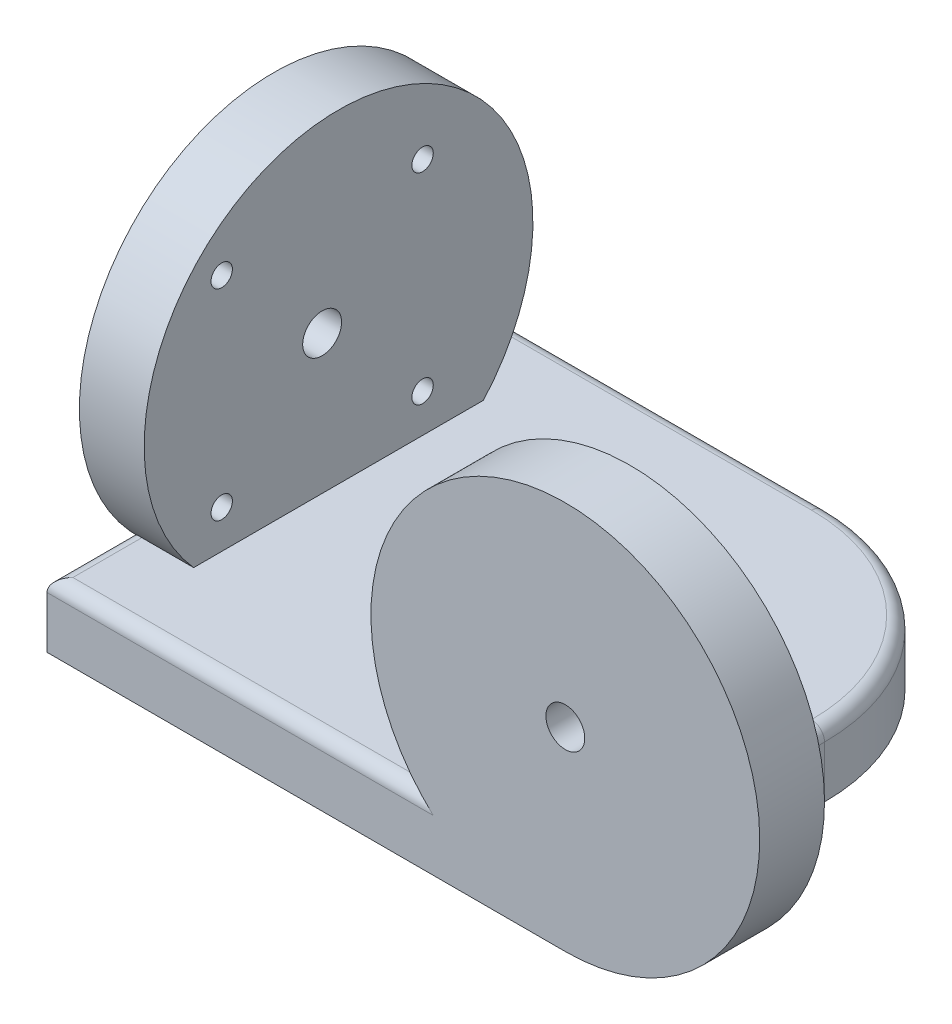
from build123d import *

# Parameters (mm, degrees)
SKETCH1_R                 = 30
BOSS_EXTRUDE1_DEPTH       = 10
SKETCH2_W                 = 80
SKETCH2_H                 = 10
BOSS_EXTRUDE2_DEPTH       = 70
SKETCH3_R                 = 30
BOSS_EXTRUDE3_DEPTH       = 10
F_6_0MM_DOWEL_HOLE2_D     = 6
M4X0_7_TAPPED_HOLE2_D     = 3.3
M4X0_7_TAPPED_HOLE2_DEPTH = 6
M4X0_7_TAPPED_HOLE2_TIP   = 0.991420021
F_6_0MM_DOWEL_HOLE4_D     = 6
M4X0_7_TAPPED_HOLE4_D     = 3.3
M4X0_7_TAPPED_HOLE4_DEPTH = 6
M4X0_7_TAPPED_HOLE4_TIP   = 0.991420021
FILLET1_R                 = 30
FILLET2_R                 = 2


with BuildPart() as part:
    # Sketch1 → Boss-Extrude1 (new body)
    with BuildSketch(Plane.XY):
        Circle(SKETCH1_R)
    extrude(amount=BOSS_EXTRUDE1_DEPTH)

    # Sketch2 → Boss-Extrude2 (add)
    with BuildSketch(Plane.XY.offset(10)):
        with Locations((-40, -25)):
            Rectangle(SKETCH2_W, SKETCH2_H)
    extrude(amount=-BOSS_EXTRUDE2_DEPTH)

    # Sketch3 → Boss-Extrude3 (add)
    with BuildSketch(Plane.ZY.offset(80)):
        with Locations((-25, 0)):
            Circle(SKETCH3_R)
    extrude(amount=-BOSS_EXTRUDE3_DEPTH)

    # 6.0mm Dowel Hole2 (through all)
    with Locations(Plane(origin=(0, 0, 0), x_dir=(-1, 0, 0), z_dir=(0, 0, -1))):
        with Locations((0, 0)):
            Hole(F_6_0MM_DOWEL_HOLE2_D / 2)

    # M4x0.7 Tapped Hole2
    with Locations(Plane(origin=(0, 0, 0), x_dir=(-1, 0, 0), z_dir=(0, 0, -1))):
        with Locations((-15.5, 15.5), (15.5, 15.5), (15.5, -15.5), (-15.5, -15.5)):
            Hole(M4X0_7_TAPPED_HOLE2_D / 2, depth=M4X0_7_TAPPED_HOLE2_DEPTH)
            with Locations((0, 0, -(M4X0_7_TAPPED_HOLE2_DEPTH + M4X0_7_TAPPED_HOLE2_TIP / 2))):  # 118° drill point
                Cone(0, M4X0_7_TAPPED_HOLE2_D / 2, M4X0_7_TAPPED_HOLE2_TIP, mode=Mode.SUBTRACT)

    # 6.0mm Dowel Hole4 (through all)
    with Locations(Plane(origin=(-70, 1.407077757, -22.469041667), x_dir=(0, 0, -1), z_dir=(1, 0, 0))):
        with Locations((0, 0)):
            Hole(F_6_0MM_DOWEL_HOLE4_D / 2)

    # M4x0.7 Tapped Hole4
    with Locations(Plane(origin=(-70, 1.407077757, -22.469041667), x_dir=(0, 0, -1), z_dir=(1, 0, 0))):
        with Locations((-15.5, 15.5), (15.5, 15.5), (15.5, -15.5), (-15.5, -15.5)):
            Hole(M4X0_7_TAPPED_HOLE4_D / 2, depth=M4X0_7_TAPPED_HOLE4_DEPTH)
            with Locations((0, 0, -(M4X0_7_TAPPED_HOLE4_DEPTH + M4X0_7_TAPPED_HOLE4_TIP / 2))):  # 118° drill point
                Cone(0, M4X0_7_TAPPED_HOLE4_D / 2, M4X0_7_TAPPED_HOLE4_TIP, mode=Mode.SUBTRACT)

    # Fillet1
    fillet1_edges = [part.edges().sort_by_distance(p)[0] for p in [
        (0, -25, -60),
    ]]
    fillet(fillet1_edges, radius=FILLET1_R)

    # Fillet2
    fillet2_edges = [part.edges().sort_by_distance(p)[0] for p in [
        (-80, -20, -53.680339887),
        (-51.180339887, -20, 10),
        (-80, -20, 3.680339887),
        (0, -20, -15),
        (-55, -20, -60),
        (-8.786796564, -20, -51.213203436),
    ]]
    fillet(fillet2_edges, radius=FILLET2_R)


solid = part.part
